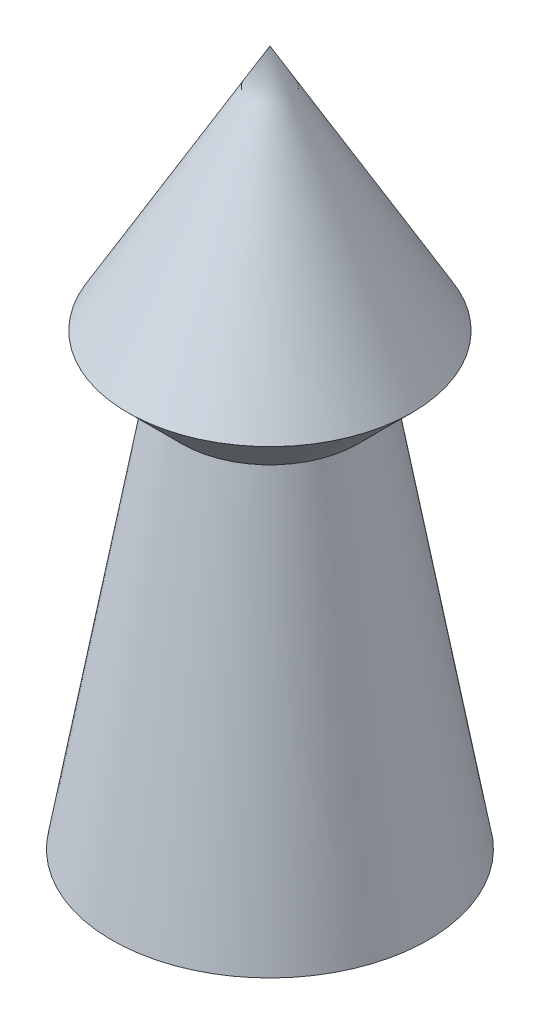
from build123d import *


with BuildPart() as part:
    # Esquisse1 → R_volution1 (revolve)
    with BuildSketch(Plane.XY, mode=Mode.PRIVATE) as r_volution1_sk:
        Polygon((0, 0), (10, 0), (5.591825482, 25), (9.001232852, 28.40940737), (0, 44), align=None)
    revolve(r_volution1_sk.sketch.rotate(Axis((0, 44, 0), (0, -1, 0)), 180), axis=Axis((0, 44, 0), (0, -1, 0)))


solid = part.part
